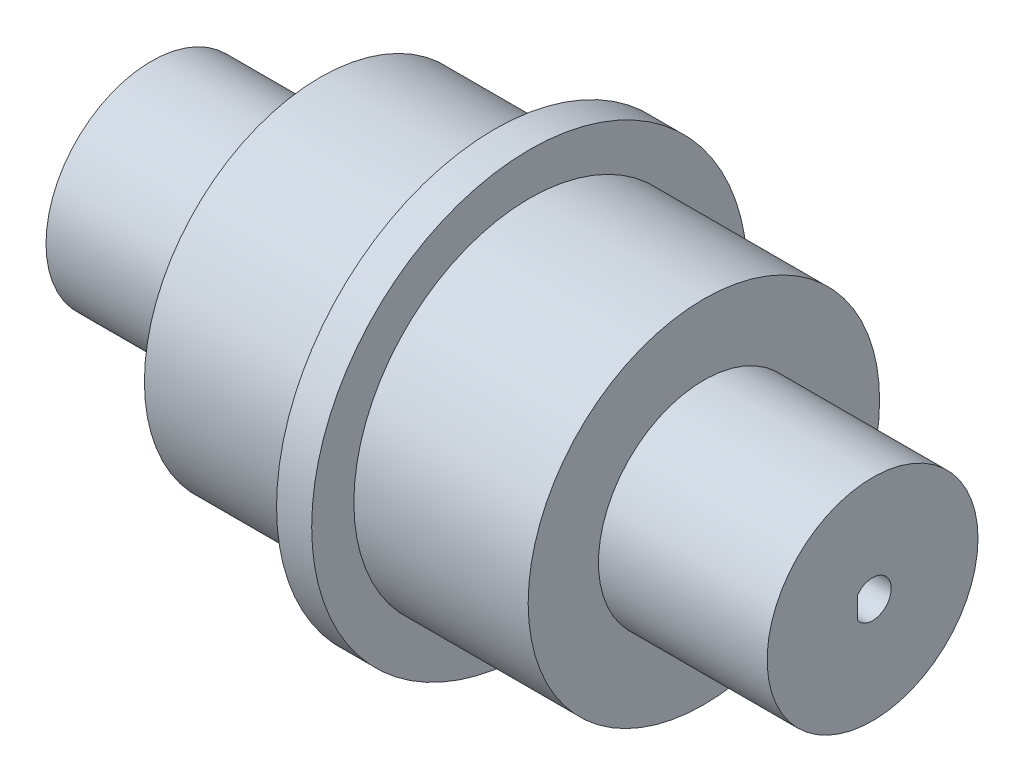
ISO-10303-21;
HEADER;
FILE_DESCRIPTION(('STEP AP214'),'2;1');
FILE_NAME('part.step','',(''),(''),'','','');
FILE_SCHEMA(('AUTOMOTIVE_DESIGN { 1 0 10303 214 1 1 1 1 }'));
ENDSEC;
DATA;
#1=APPLICATION_CONTEXT('core data for automotive mechanical design processes');
#2=APPLICATION_PROTOCOL_DEFINITION('international standard','automotive_design',2000,#1);
#3=PRODUCT_CONTEXT('',#1,'mechanical');
#4=PRODUCT('Part','Part','',(#3));
#5=PRODUCT_RELATED_PRODUCT_CATEGORY('part','',(#4));
#6=PRODUCT_DEFINITION_FORMATION('','',#4);
#7=PRODUCT_DEFINITION_CONTEXT('part definition',#1,'design');
#8=PRODUCT_DEFINITION('design','',#6,#7);
#9=PRODUCT_DEFINITION_SHAPE('','',#8);
#10=(LENGTH_UNIT() NAMED_UNIT(*) SI_UNIT(.MILLI.,.METRE.));
#11=(NAMED_UNIT(*) PLANE_ANGLE_UNIT() SI_UNIT($,.RADIAN.));
#12=(NAMED_UNIT(*) SI_UNIT($,.STERADIAN.) SOLID_ANGLE_UNIT());
#13=UNCERTAINTY_MEASURE_WITH_UNIT(LENGTH_MEASURE(1.E-05),#10,'distance_accuracy_value','');
#14=(GEOMETRIC_REPRESENTATION_CONTEXT(3) GLOBAL_UNCERTAINTY_ASSIGNED_CONTEXT((#13)) GLOBAL_UNIT_ASSIGNED_CONTEXT((#10,
#11,#12)) REPRESENTATION_CONTEXT('',''));
#15=CARTESIAN_POINT('',(0.,0.,0.));
#16=DIRECTION('',(0.,0.,1.));
#17=DIRECTION('',(1.,0.,0.));
#18=AXIS2_PLACEMENT_3D('',#15,#16,#17);
#19=CARTESIAN_POINT('',(27.3,0.,0.));
#20=DIRECTION('',(-1.,0.,0.));
#21=DIRECTION('',(0.,0.,1.));
#22=AXIS2_PLACEMENT_3D('',#19,#20,#21);
#23=CYLINDRICAL_SURFACE('',#22,25.);
#24=CARTESIAN_POINT('',(2.5,0.,0.));
#25=DIRECTION('',(1.,0.,0.));
#26=DIRECTION('',(0.,0.,-1.));
#27=AXIS2_PLACEMENT_3D('',#24,#25,#26);
#28=CIRCLE('',#27,25.);
#29=CARTESIAN_POINT('',(2.5,0.,-25.));
#30=VERTEX_POINT('',#29);
#31=EDGE_CURVE('E150',#30,#30,#28,.T.);
#32=ORIENTED_EDGE('',*,*,#31,.T.);
#33=EDGE_LOOP('',(#32));
#34=FACE_BOUND('',#33,.T.);
#35=CARTESIAN_POINT('',(27.3,0.,0.));
#36=DIRECTION('',(1.,0.,0.));
#37=DIRECTION('',(0.,0.,-1.));
#38=AXIS2_PLACEMENT_3D('',#35,#36,#37);
#39=CIRCLE('',#38,25.);
#40=CARTESIAN_POINT('',(27.3,0.,-25.));
#41=VERTEX_POINT('',#40);
#42=EDGE_CURVE('E124',#41,#41,#39,.T.);
#43=ORIENTED_EDGE('',*,*,#42,.F.);
#44=EDGE_LOOP('',(#43));
#45=FACE_BOUND('',#44,.T.);
#46=ADVANCED_FACE('F47',(#34,#45),#23,.T.);
#47=CARTESIAN_POINT('',(27.3,0.,0.));
#48=DIRECTION('',(1.,0.,0.));
#49=DIRECTION('',(0.,0.,-1.));
#50=AXIS2_PLACEMENT_3D('',#47,#48,#49);
#51=PLANE('',#50);
#52=CARTESIAN_POINT('',(27.3,0.,0.));
#53=DIRECTION('',(1.,0.,0.));
#54=DIRECTION('',(0.,0.,-1.));
#55=AXIS2_PLACEMENT_3D('',#52,#53,#54);
#56=CIRCLE('',#55,15.);
#57=CARTESIAN_POINT('',(27.3,0.,-15.));
#58=VERTEX_POINT('',#57);
#59=EDGE_CURVE('E119',#58,#58,#56,.T.);
#60=ORIENTED_EDGE('',*,*,#59,.F.);
#61=EDGE_LOOP('',(#60));
#62=FACE_BOUND('',#61,.T.);
#63=ORIENTED_EDGE('',*,*,#42,.T.);
#64=EDGE_LOOP('',(#63));
#65=FACE_BOUND('',#64,.T.);
#66=ADVANCED_FACE('F194',(#62,#65),#51,.T.);
#67=CARTESIAN_POINT('',(51.3,0.,0.));
#68=DIRECTION('',(-1.,0.,0.));
#69=DIRECTION('',(0.,0.,1.));
#70=AXIS2_PLACEMENT_3D('',#67,#68,#69);
#71=CYLINDRICAL_SURFACE('',#70,15.);
#72=CARTESIAN_POINT('',(51.3,0.,0.));
#73=DIRECTION('',(1.,0.,0.));
#74=DIRECTION('',(0.,0.,-1.));
#75=AXIS2_PLACEMENT_3D('',#72,#73,#74);
#76=CIRCLE('',#75,15.);
#77=CARTESIAN_POINT('',(51.3,0.,-15.));
#78=VERTEX_POINT('',#77);
#79=EDGE_CURVE('E136',#78,#78,#76,.T.);
#80=ORIENTED_EDGE('',*,*,#79,.F.);
#81=EDGE_LOOP('',(#80));
#82=FACE_BOUND('',#81,.T.);
#83=ORIENTED_EDGE('',*,*,#59,.T.);
#84=EDGE_LOOP('',(#83));
#85=FACE_BOUND('',#84,.T.);
#86=ADVANCED_FACE('F201',(#82,#85),#71,.T.);
#87=CARTESIAN_POINT('',(51.3,0.,0.));
#88=DIRECTION('',(1.,0.,0.));
#89=DIRECTION('',(0.,0.,-1.));
#90=AXIS2_PLACEMENT_3D('',#87,#88,#89);
#91=PLANE('',#90);
#92=CARTESIAN_POINT('',(51.3,0.,0.));
#93=DIRECTION('',(1.,0.,0.));
#94=DIRECTION('',(0.,0.,-1.));
#95=AXIS2_PLACEMENT_3D('',#92,#93,#94);
#96=CIRCLE('',#95,2.65);
#97=CARTESIAN_POINT('',(51.3,-1.54919333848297,2.15));
#98=VERTEX_POINT('',#97);
#99=CARTESIAN_POINT('',(51.3,1.54919333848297,2.15));
#100=VERTEX_POINT('',#99);
#101=EDGE_CURVE('E109',#98,#100,#96,.T.);
#102=ORIENTED_EDGE('',*,*,#101,.F.);
#103=DIRECTION('',(0.,-1.,0.));
#104=VECTOR('',#103,1.);
#105=CARTESIAN_POINT('',(51.3,1.54919333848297,2.15));
#106=LINE('',#105,#104);
#107=EDGE_CURVE('E113',#100,#98,#106,.T.);
#108=ORIENTED_EDGE('',*,*,#107,.F.);
#109=EDGE_LOOP('',(#102,#108));
#110=FACE_BOUND('',#109,.T.);
#111=ORIENTED_EDGE('',*,*,#79,.T.);
#112=EDGE_LOOP('',(#111));
#113=FACE_BOUND('',#112,.T.);
#114=ADVANCED_FACE('F221',(#110,#113),#91,.T.);
#115=CARTESIAN_POINT('',(-51.3,0.,0.));
#116=DIRECTION('',(1.,0.,0.));
#117=DIRECTION('',(0.,0.,-1.));
#118=AXIS2_PLACEMENT_3D('',#115,#116,#117);
#119=CYLINDRICAL_SURFACE('',#118,2.65);
#120=DIRECTION('',(1.,0.,0.));
#121=VECTOR('',#120,1.);
#122=CARTESIAN_POINT('',(-51.3,1.54919333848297,2.15));
#123=LINE('',#122,#121);
#124=CARTESIAN_POINT('',(2.5,1.54919333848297,2.15));
#125=VERTEX_POINT('',#124);
#126=EDGE_CURVE('E97',#125,#100,#123,.T.);
#127=ORIENTED_EDGE('',*,*,#126,.F.);
#128=CARTESIAN_POINT('',(2.5,0.,0.));
#129=DIRECTION('',(1.,0.,0.));
#130=DIRECTION('',(0.,0.,-1.));
#131=AXIS2_PLACEMENT_3D('',#128,#129,#130);
#132=CIRCLE('',#131,2.65);
#133=CARTESIAN_POINT('',(2.5,-1.54919333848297,2.15));
#134=VERTEX_POINT('',#133);
#135=EDGE_CURVE('E62',#125,#134,#132,.F.);
#136=ORIENTED_EDGE('',*,*,#135,.T.);
#137=DIRECTION('',(1.,0.,0.));
#138=VECTOR('',#137,1.);
#139=CARTESIAN_POINT('',(-51.3,-1.54919333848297,2.15));
#140=LINE('',#139,#138);
#141=EDGE_CURVE('E96',#134,#98,#140,.T.);
#142=ORIENTED_EDGE('',*,*,#141,.T.);
#143=ORIENTED_EDGE('',*,*,#101,.T.);
#144=EDGE_LOOP('',(#127,#136,#142,#143));
#145=FACE_BOUND('',#144,.T.);
#146=ADVANCED_FACE('F218',(#145),#119,.F.);
#147=CARTESIAN_POINT('',(-51.3,1.54919333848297,2.15));
#148=DIRECTION('',(0.,0.,1.));
#149=DIRECTION('',(0.,-1.,0.));
#150=AXIS2_PLACEMENT_3D('',#147,#148,#149);
#151=PLANE('',#150);
#152=ORIENTED_EDGE('',*,*,#141,.F.);
#153=DIRECTION('',(0.,1.,0.));
#154=VECTOR('',#153,1.);
#155=CARTESIAN_POINT('',(2.5,1.54919333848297,2.15));
#156=LINE('',#155,#154);
#157=EDGE_CURVE('E50',#134,#125,#156,.T.);
#158=ORIENTED_EDGE('',*,*,#157,.T.);
#159=ORIENTED_EDGE('',*,*,#126,.T.);
#160=ORIENTED_EDGE('',*,*,#107,.T.);
#161=EDGE_LOOP('',(#152,#158,#159,#160));
#162=FACE_BOUND('',#161,.T.);
#163=ADVANCED_FACE('F214',(#162),#151,.F.);
#164=CARTESIAN_POINT('',(2.5,0.,0.));
#165=DIRECTION('',(1.,0.,0.));
#166=DIRECTION('',(0.,0.,-1.));
#167=AXIS2_PLACEMENT_3D('',#164,#165,#166);
#168=PLANE('',#167);
#169=ORIENTED_EDGE('',*,*,#135,.F.);
#170=ORIENTED_EDGE('',*,*,#157,.F.);
#171=EDGE_LOOP('',(#169,#170));
#172=FACE_BOUND('',#171,.T.);
#173=ADVANCED_FACE('F209',(#172),#168,.T.);
#174=CARTESIAN_POINT('',(2.5,0.,0.));
#175=DIRECTION('',(1.,0.,0.));
#176=DIRECTION('',(0.,0.,-1.));
#177=AXIS2_PLACEMENT_3D('',#174,#175,#176);
#178=CIRCLE('',#177,31.);
#179=CARTESIAN_POINT('',(2.5,0.,-31.));
#180=VERTEX_POINT('',#179);
#181=EDGE_CURVE('E105',#180,#180,#178,.T.);
#182=ORIENTED_EDGE('',*,*,#181,.T.);
#183=EDGE_LOOP('',(#182));
#184=FACE_BOUND('',#183,.T.);
#185=ORIENTED_EDGE('',*,*,#31,.F.);
#186=EDGE_LOOP('',(#185));
#187=FACE_BOUND('',#186,.T.);
#188=ADVANCED_FACE('F164',(#184,#187),#168,.T.);
#189=CARTESIAN_POINT('',(-2.5,0.,0.));
#190=DIRECTION('',(1.,0.,0.));
#191=DIRECTION('',(0.,0.,-1.));
#192=AXIS2_PLACEMENT_3D('',#189,#190,#191);
#193=PLANE('',#192);
#194=CARTESIAN_POINT('',(-2.5,0.,0.));
#195=DIRECTION('',(1.,0.,0.));
#196=DIRECTION('',(0.,0.,-1.));
#197=AXIS2_PLACEMENT_3D('',#194,#195,#196);
#198=CIRCLE('',#197,31.);
#199=CARTESIAN_POINT('',(-2.5,0.,-31.));
#200=VERTEX_POINT('',#199);
#201=EDGE_CURVE('E156',#200,#200,#198,.T.);
#202=ORIENTED_EDGE('',*,*,#201,.F.);
#203=EDGE_LOOP('',(#202));
#204=FACE_BOUND('',#203,.T.);
#205=CARTESIAN_POINT('',(-2.5,0.,0.));
#206=DIRECTION('',(1.,0.,0.));
#207=DIRECTION('',(0.,0.,-1.));
#208=AXIS2_PLACEMENT_3D('',#205,#206,#207);
#209=CIRCLE('',#208,25.);
#210=CARTESIAN_POINT('',(-2.5,0.,-25.));
#211=VERTEX_POINT('',#210);
#212=EDGE_CURVE('E11',#211,#211,#209,.T.);
#213=ORIENTED_EDGE('',*,*,#212,.T.);
#214=EDGE_LOOP('',(#213));
#215=FACE_BOUND('',#214,.T.);
#216=ADVANCED_FACE('F171',(#204,#215),#193,.F.);
#217=CARTESIAN_POINT('',(2.5,0.,0.));
#218=DIRECTION('',(-1.,0.,0.));
#219=DIRECTION('',(0.,0.,1.));
#220=AXIS2_PLACEMENT_3D('',#217,#218,#219);
#221=CYLINDRICAL_SURFACE('',#220,31.);
#222=ORIENTED_EDGE('',*,*,#181,.F.);
#223=EDGE_LOOP('',(#222));
#224=FACE_BOUND('',#223,.T.);
#225=ORIENTED_EDGE('',*,*,#201,.T.);
#226=EDGE_LOOP('',(#225));
#227=FACE_BOUND('',#226,.T.);
#228=ADVANCED_FACE('F167',(#224,#227),#221,.T.);
#229=CARTESIAN_POINT('',(-27.3,0.,0.));
#230=DIRECTION('',(1.,0.,0.));
#231=DIRECTION('',(0.,0.,-1.));
#232=AXIS2_PLACEMENT_3D('',#229,#230,#231);
#233=PLANE('',#232);
#234=CARTESIAN_POINT('',(-27.3,0.,0.));
#235=DIRECTION('',(-1.,0.,0.));
#236=DIRECTION('',(0.,0.,1.));
#237=AXIS2_PLACEMENT_3D('',#234,#235,#236);
#238=CIRCLE('',#237,15.);
#239=CARTESIAN_POINT('',(-27.3,0.,15.));
#240=VERTEX_POINT('',#239);
#241=EDGE_CURVE('E129',#240,#240,#238,.T.);
#242=ORIENTED_EDGE('',*,*,#241,.F.);
#243=EDGE_LOOP('',(#242));
#244=FACE_BOUND('',#243,.T.);
#245=CARTESIAN_POINT('',(-27.3,0.,0.));
#246=DIRECTION('',(1.,0.,0.));
#247=DIRECTION('',(0.,0.,-1.));
#248=AXIS2_PLACEMENT_3D('',#245,#246,#247);
#249=CIRCLE('',#248,25.);
#250=CARTESIAN_POINT('',(-27.3,0.,-25.));
#251=VERTEX_POINT('',#250);
#252=EDGE_CURVE('E120',#251,#251,#249,.T.);
#253=ORIENTED_EDGE('',*,*,#252,.F.);
#254=EDGE_LOOP('',(#253));
#255=FACE_BOUND('',#254,.T.);
#256=ADVANCED_FACE('F170',(#244,#255),#233,.F.);
#257=ORIENTED_EDGE('',*,*,#252,.T.);
#258=EDGE_LOOP('',(#257));
#259=FACE_BOUND('',#258,.T.);
#260=ORIENTED_EDGE('',*,*,#212,.F.);
#261=EDGE_LOOP('',(#260));
#262=FACE_BOUND('',#261,.T.);
#263=ADVANCED_FACE('F180',(#259,#262),#23,.T.);
#264=CARTESIAN_POINT('',(-51.3,0.,0.));
#265=DIRECTION('',(1.,0.,0.));
#266=DIRECTION('',(0.,0.,-1.));
#267=AXIS2_PLACEMENT_3D('',#264,#265,#266);
#268=CYLINDRICAL_SURFACE('',#267,15.);
#269=CARTESIAN_POINT('',(-51.3,0.,0.));
#270=DIRECTION('',(-1.,0.,0.));
#271=DIRECTION('',(0.,0.,1.));
#272=AXIS2_PLACEMENT_3D('',#269,#270,#271);
#273=CIRCLE('',#272,15.);
#274=CARTESIAN_POINT('',(-51.3,0.,15.));
#275=VERTEX_POINT('',#274);
#276=EDGE_CURVE('E125',#275,#275,#273,.T.);
#277=ORIENTED_EDGE('',*,*,#276,.F.);
#278=EDGE_LOOP('',(#277));
#279=FACE_BOUND('',#278,.T.);
#280=ORIENTED_EDGE('',*,*,#241,.T.);
#281=EDGE_LOOP('',(#280));
#282=FACE_BOUND('',#281,.T.);
#283=ADVANCED_FACE('F182',(#279,#282),#268,.T.);
#284=CARTESIAN_POINT('',(-51.3,0.,0.));
#285=DIRECTION('',(-1.,0.,0.));
#286=DIRECTION('',(0.,0.,1.));
#287=AXIS2_PLACEMENT_3D('',#284,#285,#286);
#288=PLANE('',#287);
#289=CARTESIAN_POINT('',(-51.3,0.,0.));
#290=DIRECTION('',(1.,0.,0.));
#291=DIRECTION('',(0.,0.,-1.));
#292=AXIS2_PLACEMENT_3D('',#289,#290,#291);
#293=CIRCLE('',#292,2.65);
#294=CARTESIAN_POINT('',(-51.3,-1.54919333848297,2.15));
#295=VERTEX_POINT('',#294);
#296=CARTESIAN_POINT('',(-51.3,1.54919333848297,2.15));
#297=VERTEX_POINT('',#296);
#298=EDGE_CURVE('E147',#295,#297,#293,.T.);
#299=ORIENTED_EDGE('',*,*,#298,.T.);
#300=DIRECTION('',(0.,-1.,0.));
#301=VECTOR('',#300,1.);
#302=CARTESIAN_POINT('',(-51.3,1.54919333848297,2.15));
#303=LINE('',#302,#301);
#304=EDGE_CURVE('E92',#297,#295,#303,.T.);
#305=ORIENTED_EDGE('',*,*,#304,.T.);
#306=EDGE_LOOP('',(#299,#305));
#307=FACE_BOUND('',#306,.T.);
#308=ORIENTED_EDGE('',*,*,#276,.T.);
#309=EDGE_LOOP('',(#308));
#310=FACE_BOUND('',#309,.T.);
#311=ADVANCED_FACE('F188',(#307,#310),#288,.T.);
#312=DIRECTION('',(0.,1.,0.));
#313=VECTOR('',#312,1.);
#314=CARTESIAN_POINT('',(-2.5,1.54919333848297,2.15));
#315=LINE('',#314,#313);
#316=CARTESIAN_POINT('',(-2.5,-1.54919333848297,2.15));
#317=VERTEX_POINT('',#316);
#318=CARTESIAN_POINT('',(-2.5,1.54919333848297,2.15));
#319=VERTEX_POINT('',#318);
#320=EDGE_CURVE('E70',#317,#319,#315,.T.);
#321=ORIENTED_EDGE('',*,*,#320,.F.);
#322=EDGE_CURVE('E102',#295,#317,#140,.T.);
#323=ORIENTED_EDGE('',*,*,#322,.F.);
#324=ORIENTED_EDGE('',*,*,#304,.F.);
#325=EDGE_CURVE('E88',#297,#319,#123,.T.);
#326=ORIENTED_EDGE('',*,*,#325,.T.);
#327=EDGE_LOOP('',(#321,#323,#324,#326));
#328=FACE_BOUND('',#327,.T.);
#329=ADVANCED_FACE('F90',(#328),#151,.F.);
#330=CARTESIAN_POINT('',(-2.5,0.,0.));
#331=DIRECTION('',(1.,0.,0.));
#332=DIRECTION('',(0.,0.,-1.));
#333=AXIS2_PLACEMENT_3D('',#330,#331,#332);
#334=CIRCLE('',#333,2.65);
#335=EDGE_CURVE('E100',#319,#317,#334,.F.);
#336=ORIENTED_EDGE('',*,*,#335,.F.);
#337=ORIENTED_EDGE('',*,*,#325,.F.);
#338=ORIENTED_EDGE('',*,*,#298,.F.);
#339=ORIENTED_EDGE('',*,*,#322,.T.);
#340=EDGE_LOOP('',(#336,#337,#338,#339));
#341=FACE_BOUND('',#340,.T.);
#342=ADVANCED_FACE('F101',(#341),#119,.F.);
#343=ORIENTED_EDGE('',*,*,#320,.T.);
#344=ORIENTED_EDGE('',*,*,#335,.T.);
#345=EDGE_LOOP('',(#343,#344));
#346=FACE_BOUND('',#345,.T.);
#347=ADVANCED_FACE('F107',(#346),#193,.F.);
#348=CLOSED_SHELL('',(#46,#66,#86,#114,#146,#163,#173,#188,#216,#228,#256,#263,#283,#311,#329,
#342,#347));
#349=MANIFOLD_SOLID_BREP('B2',#348);
#350=ADVANCED_BREP_SHAPE_REPRESENTATION('',(#18,#349),#14);
#351=SHAPE_DEFINITION_REPRESENTATION(#9,#350);
ENDSEC;
END-ISO-10303-21;
